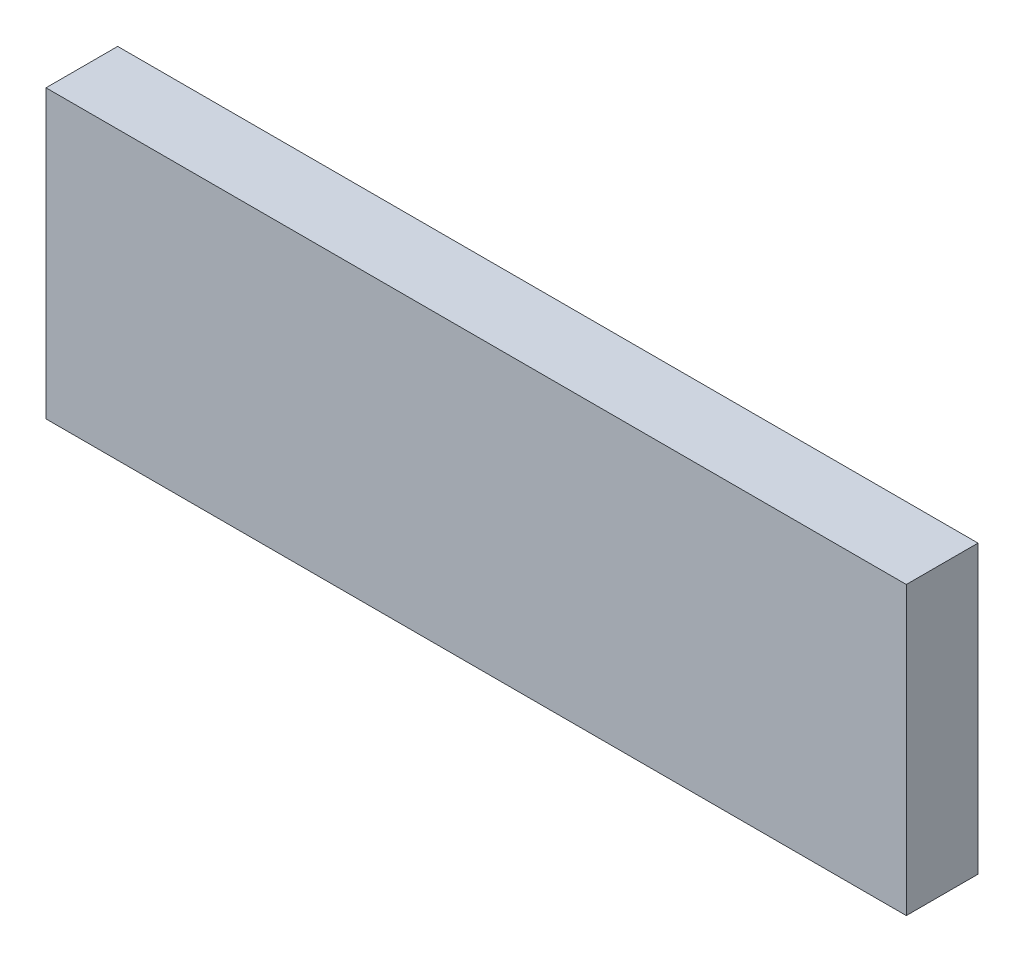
ISO-10303-21;
HEADER;
FILE_DESCRIPTION(('STEP AP214'),'2;1');
FILE_NAME('part.step','',(''),(''),'','','');
FILE_SCHEMA(('AUTOMOTIVE_DESIGN { 1 0 10303 214 1 1 1 1 }'));
ENDSEC;
DATA;
#1=APPLICATION_CONTEXT('core data for automotive mechanical design processes');
#2=APPLICATION_PROTOCOL_DEFINITION('international standard','automotive_design',2000,#1);
#3=PRODUCT_CONTEXT('',#1,'mechanical');
#4=PRODUCT('Part','Part','',(#3));
#5=PRODUCT_RELATED_PRODUCT_CATEGORY('part','',(#4));
#6=PRODUCT_DEFINITION_FORMATION('','',#4);
#7=PRODUCT_DEFINITION_CONTEXT('part definition',#1,'design');
#8=PRODUCT_DEFINITION('design','',#6,#7);
#9=PRODUCT_DEFINITION_SHAPE('','',#8);
#10=(LENGTH_UNIT() NAMED_UNIT(*) SI_UNIT(.MILLI.,.METRE.));
#11=(NAMED_UNIT(*) PLANE_ANGLE_UNIT() SI_UNIT($,.RADIAN.));
#12=(NAMED_UNIT(*) SI_UNIT($,.STERADIAN.) SOLID_ANGLE_UNIT());
#13=UNCERTAINTY_MEASURE_WITH_UNIT(LENGTH_MEASURE(1.E-05),#10,'distance_accuracy_value','');
#14=(GEOMETRIC_REPRESENTATION_CONTEXT(3) GLOBAL_UNCERTAINTY_ASSIGNED_CONTEXT((#13)) GLOBAL_UNIT_ASSIGNED_CONTEXT((#10,
#11,#12)) REPRESENTATION_CONTEXT('',''));
#15=CARTESIAN_POINT('',(0.,0.,0.));
#16=DIRECTION('',(0.,0.,1.));
#17=DIRECTION('',(1.,0.,0.));
#18=AXIS2_PLACEMENT_3D('',#15,#16,#17);
#19=CARTESIAN_POINT('',(-30.,-10.,2.5));
#20=DIRECTION('',(1.,0.,0.));
#21=DIRECTION('',(0.,0.,-1.));
#22=AXIS2_PLACEMENT_3D('',#19,#20,#21);
#23=PLANE('',#22);
#24=DIRECTION('',(0.,-1.,0.));
#25=VECTOR('',#24,1.);
#26=CARTESIAN_POINT('',(-30.,-10.,-2.5));
#27=LINE('',#26,#25);
#28=CARTESIAN_POINT('',(-30.,10.,-2.5));
#29=VERTEX_POINT('',#28);
#30=CARTESIAN_POINT('',(-30.,-10.,-2.5));
#31=VERTEX_POINT('',#30);
#32=EDGE_CURVE('E96',#29,#31,#27,.T.);
#33=ORIENTED_EDGE('',*,*,#32,.T.);
#34=DIRECTION('',(0.,0.,-1.));
#35=VECTOR('',#34,1.);
#36=CARTESIAN_POINT('',(-30.,-10.,2.5));
#37=LINE('',#36,#35);
#38=CARTESIAN_POINT('',(-30.,-10.,2.5));
#39=VERTEX_POINT('',#38);
#40=EDGE_CURVE('E11',#39,#31,#37,.T.);
#41=ORIENTED_EDGE('',*,*,#40,.F.);
#42=DIRECTION('',(0.,-1.,0.));
#43=VECTOR('',#42,1.);
#44=CARTESIAN_POINT('',(-30.,-10.,2.5));
#45=LINE('',#44,#43);
#46=CARTESIAN_POINT('',(-30.,10.,2.5));
#47=VERTEX_POINT('',#46);
#48=EDGE_CURVE('E84',#47,#39,#45,.T.);
#49=ORIENTED_EDGE('',*,*,#48,.F.);
#50=DIRECTION('',(0.,0.,-1.));
#51=VECTOR('',#50,1.);
#52=CARTESIAN_POINT('',(-30.,10.,2.5));
#53=LINE('',#52,#51);
#54=EDGE_CURVE('E92',#47,#29,#53,.T.);
#55=ORIENTED_EDGE('',*,*,#54,.T.);
#56=EDGE_LOOP('',(#33,#41,#49,#55));
#57=FACE_BOUND('',#56,.T.);
#58=ADVANCED_FACE('F33',(#57),#23,.F.);
#59=CARTESIAN_POINT('',(30.,-9.99999999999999,2.5));
#60=DIRECTION('',(0.,1.,0.));
#61=DIRECTION('',(-1.,0.,0.));
#62=AXIS2_PLACEMENT_3D('',#59,#60,#61);
#63=PLANE('',#62);
#64=DIRECTION('',(1.,0.,0.));
#65=VECTOR('',#64,1.);
#66=CARTESIAN_POINT('',(30.,-9.99999999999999,-2.5));
#67=LINE('',#66,#65);
#68=CARTESIAN_POINT('',(30.,-9.99999999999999,-2.5));
#69=VERTEX_POINT('',#68);
#70=EDGE_CURVE('E88',#31,#69,#67,.T.);
#71=ORIENTED_EDGE('',*,*,#70,.T.);
#72=DIRECTION('',(0.,0.,-1.));
#73=VECTOR('',#72,1.);
#74=CARTESIAN_POINT('',(30.,-9.99999999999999,2.5));
#75=LINE('',#74,#73);
#76=CARTESIAN_POINT('',(30.,-9.99999999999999,2.5));
#77=VERTEX_POINT('',#76);
#78=EDGE_CURVE('E41',#77,#69,#75,.T.);
#79=ORIENTED_EDGE('',*,*,#78,.F.);
#80=DIRECTION('',(1.,0.,0.));
#81=VECTOR('',#80,1.);
#82=CARTESIAN_POINT('',(30.,-9.99999999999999,2.5));
#83=LINE('',#82,#81);
#84=EDGE_CURVE('E79',#39,#77,#83,.T.);
#85=ORIENTED_EDGE('',*,*,#84,.F.);
#86=ORIENTED_EDGE('',*,*,#40,.T.);
#87=EDGE_LOOP('',(#71,#79,#85,#86));
#88=FACE_BOUND('',#87,.T.);
#89=ADVANCED_FACE('F87',(#88),#63,.F.);
#90=CARTESIAN_POINT('',(30.,-9.99999999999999,2.5));
#91=DIRECTION('',(-1.,0.,0.));
#92=DIRECTION('',(0.,0.,1.));
#93=AXIS2_PLACEMENT_3D('',#90,#91,#92);
#94=PLANE('',#93);
#95=DIRECTION('',(0.,1.,0.));
#96=VECTOR('',#95,1.);
#97=CARTESIAN_POINT('',(30.,-9.99999999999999,-2.5));
#98=LINE('',#97,#96);
#99=CARTESIAN_POINT('',(30.,10.,-2.5));
#100=VERTEX_POINT('',#99);
#101=EDGE_CURVE('E66',#69,#100,#98,.T.);
#102=ORIENTED_EDGE('',*,*,#101,.T.);
#103=DIRECTION('',(0.,0.,-1.));
#104=VECTOR('',#103,1.);
#105=CARTESIAN_POINT('',(30.,10.,2.5));
#106=LINE('',#105,#104);
#107=CARTESIAN_POINT('',(30.,10.,2.5));
#108=VERTEX_POINT('',#107);
#109=EDGE_CURVE('E89',#108,#100,#106,.T.);
#110=ORIENTED_EDGE('',*,*,#109,.F.);
#111=DIRECTION('',(0.,1.,0.));
#112=VECTOR('',#111,1.);
#113=CARTESIAN_POINT('',(30.,-9.99999999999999,2.5));
#114=LINE('',#113,#112);
#115=EDGE_CURVE('E82',#77,#108,#114,.T.);
#116=ORIENTED_EDGE('',*,*,#115,.F.);
#117=ORIENTED_EDGE('',*,*,#78,.T.);
#118=EDGE_LOOP('',(#102,#110,#116,#117));
#119=FACE_BOUND('',#118,.T.);
#120=ADVANCED_FACE('F90',(#119),#94,.F.);
#121=CARTESIAN_POINT('',(30.,10.,2.5));
#122=DIRECTION('',(0.,-1.,0.));
#123=DIRECTION('',(1.,0.,0.));
#124=AXIS2_PLACEMENT_3D('',#121,#122,#123);
#125=PLANE('',#124);
#126=DIRECTION('',(-1.,0.,0.));
#127=VECTOR('',#126,1.);
#128=CARTESIAN_POINT('',(30.,10.,-2.5));
#129=LINE('',#128,#127);
#130=EDGE_CURVE('E72',#100,#29,#129,.T.);
#131=ORIENTED_EDGE('',*,*,#130,.T.);
#132=ORIENTED_EDGE('',*,*,#54,.F.);
#133=DIRECTION('',(-1.,0.,0.));
#134=VECTOR('',#133,1.);
#135=CARTESIAN_POINT('',(30.,10.,2.5));
#136=LINE('',#135,#134);
#137=EDGE_CURVE('E49',#108,#47,#136,.T.);
#138=ORIENTED_EDGE('',*,*,#137,.F.);
#139=ORIENTED_EDGE('',*,*,#109,.T.);
#140=EDGE_LOOP('',(#131,#132,#138,#139));
#141=FACE_BOUND('',#140,.T.);
#142=ADVANCED_FACE('F103',(#141),#125,.F.);
#143=CARTESIAN_POINT('',(0.,0.,2.5));
#144=DIRECTION('',(0.,0.,1.));
#145=DIRECTION('',(1.,0.,0.));
#146=AXIS2_PLACEMENT_3D('',#143,#144,#145);
#147=PLANE('',#146);
#148=ORIENTED_EDGE('',*,*,#48,.T.);
#149=ORIENTED_EDGE('',*,*,#84,.T.);
#150=ORIENTED_EDGE('',*,*,#115,.T.);
#151=ORIENTED_EDGE('',*,*,#137,.T.);
#152=EDGE_LOOP('',(#148,#149,#150,#151));
#153=FACE_BOUND('',#152,.T.);
#154=ADVANCED_FACE('F80',(#153),#147,.T.);
#155=CARTESIAN_POINT('',(0.,0.,-2.5));
#156=DIRECTION('',(0.,0.,1.));
#157=DIRECTION('',(1.,0.,0.));
#158=AXIS2_PLACEMENT_3D('',#155,#156,#157);
#159=PLANE('',#158);
#160=ORIENTED_EDGE('',*,*,#32,.F.);
#161=ORIENTED_EDGE('',*,*,#130,.F.);
#162=ORIENTED_EDGE('',*,*,#101,.F.);
#163=ORIENTED_EDGE('',*,*,#70,.F.);
#164=EDGE_LOOP('',(#160,#161,#162,#163));
#165=FACE_BOUND('',#164,.T.);
#166=ADVANCED_FACE('F106',(#165),#159,.F.);
#167=CLOSED_SHELL('',(#58,#89,#120,#142,#154,#166));
#168=MANIFOLD_SOLID_BREP('B2',#167);
#169=ADVANCED_BREP_SHAPE_REPRESENTATION('',(#18,#168),#14);
#170=SHAPE_DEFINITION_REPRESENTATION(#9,#169);
ENDSEC;
END-ISO-10303-21;
